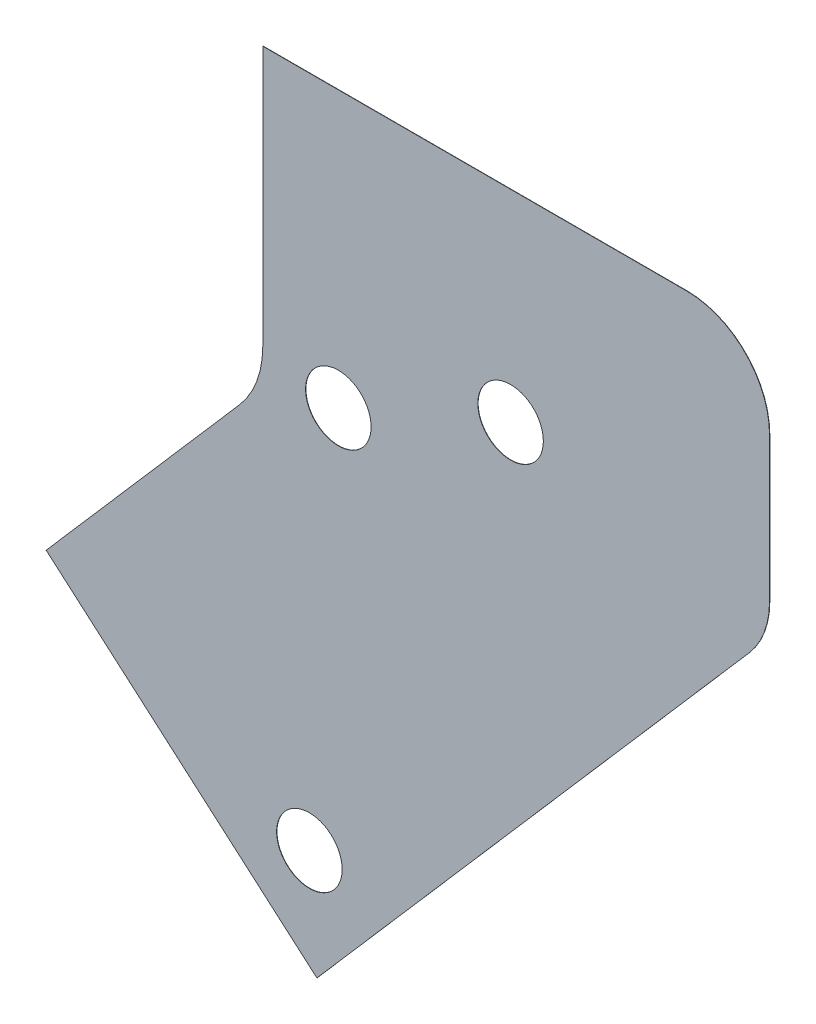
from build123d import *

# Parameters (mm, degrees)
BOSS_EXTRUDE1_DEPTH = 0.0254
HOLE1_D             = 5.6134


with BuildPart() as part:
    # Sketch1 → Boss-Extrude1 (new body)
    with BuildSketch(Plane.XY):
        with BuildLine():
            Line((-658.42792782, -80.557302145), (-621.375225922, -37.890951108))
            ThreePointArc((-621.375225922, -37.890951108), (-620.082779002, -35.716729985), (-619.633, -33.227682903))
            Line((-619.633, -33.227682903), (-619.633, -20.819872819))
            ThreePointArc((-619.633, -20.819872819), (-621.716056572, -15.790929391), (-626.745, -13.707872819))
            Line((-626.745, -13.707872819), (-663.067, -13.707872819))
            Line((-663.067, -13.707872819), (-663.067, -35.989792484))
            ThreePointArc((-663.067, -35.989792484), (-663.581033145, -38.834417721), (-665.058115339, -41.319241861))
            Line((-665.058115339, -41.319241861), (-681.633022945, -60.40532169))
            Line((-681.633022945, -60.40532169), (-658.42792782, -80.557302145))
        make_face()
    extrude(amount=BOSS_EXTRUDE1_DEPTH)

    # Hole1 (through all)
    with Locations(Plane(origin=(-662.725613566, -60.818926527, 0.0254), x_dir=(1, 0, 0), z_dir=(0, 0, 1))):
        with Locations((3.654260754, -10.601140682), (6.135613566, 23.489053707), (20.899817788, 29.810334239)):
            Hole(HOLE1_D / 2)


solid = part.part
